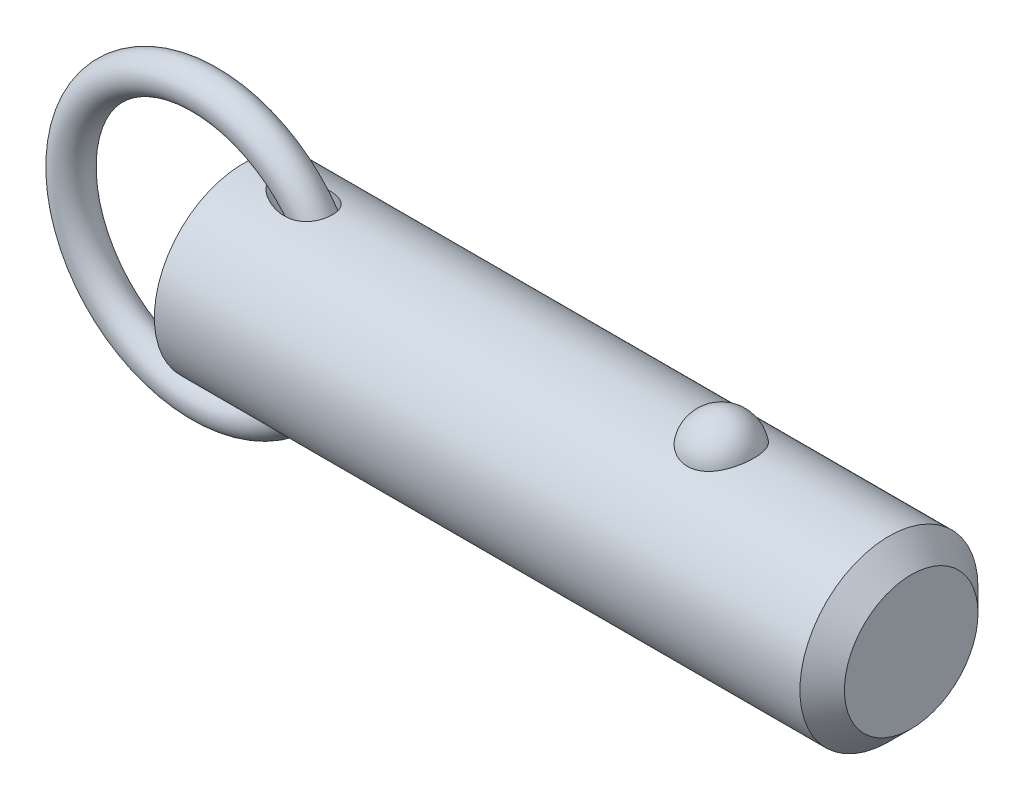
ISO-10303-21;
HEADER;
FILE_DESCRIPTION(('STEP AP214'),'2;1');
FILE_NAME('part.step','',(''),(''),'','','');
FILE_SCHEMA(('AUTOMOTIVE_DESIGN { 1 0 10303 214 1 1 1 1 }'));
ENDSEC;
DATA;
#1=APPLICATION_CONTEXT('core data for automotive mechanical design processes');
#2=APPLICATION_PROTOCOL_DEFINITION('international standard','automotive_design',2000,#1);
#3=PRODUCT_CONTEXT('',#1,'mechanical');
#4=PRODUCT('Part','Part','',(#3));
#5=PRODUCT_RELATED_PRODUCT_CATEGORY('part','',(#4));
#6=PRODUCT_DEFINITION_FORMATION('','',#4);
#7=PRODUCT_DEFINITION_CONTEXT('part definition',#1,'design');
#8=PRODUCT_DEFINITION('design','',#6,#7);
#9=PRODUCT_DEFINITION_SHAPE('','',#8);
#10=(LENGTH_UNIT() NAMED_UNIT(*) SI_UNIT(.MILLI.,.METRE.));
#11=(NAMED_UNIT(*) PLANE_ANGLE_UNIT() SI_UNIT($,.RADIAN.));
#12=(NAMED_UNIT(*) SI_UNIT($,.STERADIAN.) SOLID_ANGLE_UNIT());
#13=UNCERTAINTY_MEASURE_WITH_UNIT(LENGTH_MEASURE(1.E-05),#10,'distance_accuracy_value','');
#14=(GEOMETRIC_REPRESENTATION_CONTEXT(3) GLOBAL_UNCERTAINTY_ASSIGNED_CONTEXT((#13)) GLOBAL_UNIT_ASSIGNED_CONTEXT((#10,
#11,#12)) REPRESENTATION_CONTEXT('',''));
#15=CARTESIAN_POINT('',(0.,0.,0.));
#16=DIRECTION('',(0.,0.,1.));
#17=DIRECTION('',(1.,0.,0.));
#18=AXIS2_PLACEMENT_3D('',#15,#16,#17);
#19=CARTESIAN_POINT('',(-5.53898640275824,0.,0.));
#20=DIRECTION('',(0.,0.,1.));
#21=DIRECTION('',(1.,0.,0.));
#22=AXIS2_PLACEMENT_3D('',#19,#20,#21);
#23=TOROIDAL_SURFACE('',#22,19.05,2.54);
#24=CARTESIAN_POINT('',(16.0510135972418,0.,0.));
#25=VERTEX_POINT('',#24);
#26=VERTEX_LOOP('',#25);
#27=FACE_BOUND('',#26,.T.);
#28=ADVANCED_FACE('P0_F12',(#27),#23,.T.);
#29=CLOSED_SHELL('',(#28));
#30=MANIFOLD_SOLID_BREP('P0_B1',#29);
#31=CARTESIAN_POINT('',(0.,0.,0.));
#32=DIRECTION('',(1.,0.,0.));
#33=DIRECTION('',(0.,0.,-1.));
#34=AXIS2_PLACEMENT_3D('',#31,#32,#33);
#35=CYLINDRICAL_SURFACE('',#34,12.7);
#36=CARTESIAN_POINT('',(92.075,0.,0.));
#37=DIRECTION('',(1.,0.,0.));
#38=DIRECTION('',(0.,0.,-1.));
#39=AXIS2_PLACEMENT_3D('',#36,#37,#38);
#40=CIRCLE('',#39,12.7);
#41=CARTESIAN_POINT('',(92.075,0.,-12.7));
#42=VERTEX_POINT('',#41);
#43=EDGE_CURVE('P1_E89',#42,#42,#40,.T.);
#44=ORIENTED_EDGE('',*,*,#43,.F.);
#45=EDGE_LOOP('',(#44));
#46=FACE_BOUND('',#45,.T.);
#47=CARTESIAN_POINT('',(0.,0.,0.));
#48=DIRECTION('',(1.,0.,0.));
#49=DIRECTION('',(0.,0.,-1.));
#50=AXIS2_PLACEMENT_3D('',#47,#48,#49);
#51=CIRCLE('',#50,12.7);
#52=CARTESIAN_POINT('',(0.,0.,-12.7));
#53=VERTEX_POINT('',#52);
#54=EDGE_CURVE('P1_E52',#53,#53,#51,.T.);
#55=ORIENTED_EDGE('',*,*,#54,.T.);
#56=EDGE_LOOP('',(#55));
#57=FACE_BOUND('',#56,.T.);
#58=CARTESIAN_POINT('',(68.1600429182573,11.7500437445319,4.8193850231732));
#59=CARTESIAN_POINT('',(68.0350881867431,11.7500430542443,4.81938571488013));
#60=CARTESIAN_POINT('',(67.910144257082,11.7520975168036,4.81438658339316));
#61=CARTESIAN_POINT('',(67.6611425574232,11.760253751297,4.79442904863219));
#62=CARTESIAN_POINT('',(67.5370850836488,11.7663568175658,4.77946746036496));
#63=CARTESIAN_POINT('',(67.2909016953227,11.7824262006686,4.73971414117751));
#64=CARTESIAN_POINT('',(67.1687744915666,11.7923898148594,4.71492928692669));
#65=CARTESIAN_POINT('',(66.9271874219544,11.8158938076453,4.65571340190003));
#66=CARTESIAN_POINT('',(66.8077285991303,11.8294355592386,4.62127866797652));
#67=CARTESIAN_POINT('',(66.5725578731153,11.8596812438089,4.54309502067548));
#68=CARTESIAN_POINT('',(66.4568393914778,11.8763792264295,4.4993636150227));
#69=CARTESIAN_POINT('',(66.2296530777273,11.9124878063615,4.40287235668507));
#70=CARTESIAN_POINT('',(66.1181868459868,11.9318994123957,4.35010914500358));
#71=CARTESIAN_POINT('',(65.7912782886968,11.9934256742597,4.17881316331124));
#72=CARTESIAN_POINT('',(65.5831270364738,12.038858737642,4.04720756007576));
#73=CARTESIAN_POINT('',(65.1858509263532,12.1352173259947,3.74856446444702));
#74=CARTESIAN_POINT('',(64.9974438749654,12.1862630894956,3.58061821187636));
#75=CARTESIAN_POINT('',(64.6505213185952,12.2875163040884,3.21600758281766));
#76=CARTESIAN_POINT('',(64.4920113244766,12.3377235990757,3.01933792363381));
#77=CARTESIAN_POINT('',(64.2016887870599,12.434492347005,2.59291655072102));
#78=CARTESIAN_POINT('',(64.0713762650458,12.4807925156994,2.36208286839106));
#79=CARTESIAN_POINT('',(63.8494079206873,12.5623454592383,1.88070399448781));
#80=CARTESIAN_POINT('',(63.7577554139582,12.5975972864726,1.63015711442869));
#81=CARTESIAN_POINT('',(63.6140466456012,12.6538414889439,1.11298869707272));
#82=CARTESIAN_POINT('',(63.5624990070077,12.6746503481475,0.846205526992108));
#83=CARTESIAN_POINT('',(63.5019771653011,12.699153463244,0.307085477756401));
#84=CARTESIAN_POINT('',(63.4930018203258,12.7028481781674,0.034748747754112));
#85=CARTESIAN_POINT('',(63.5177310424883,12.6927785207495,-0.506073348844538));
#86=CARTESIAN_POINT('',(63.5511899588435,12.6791146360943,-0.774571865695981));
#87=CARTESIAN_POINT('',(63.6596877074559,12.635882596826,-1.3017024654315));
#88=CARTESIAN_POINT('',(63.7347272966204,12.6063141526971,-1.56033436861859));
#89=CARTESIAN_POINT('',(63.9250000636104,12.5342328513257,-2.06083899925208));
#90=CARTESIAN_POINT('',(64.0402872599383,12.4917026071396,-2.3026886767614));
#91=CARTESIAN_POINT('',(64.3087044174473,12.3981123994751,-2.76259600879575));
#92=CARTESIAN_POINT('',(64.4618374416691,12.3470517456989,-2.98065173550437));
#93=CARTESIAN_POINT('',(64.8035077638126,12.2416045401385,-3.38786328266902));
#94=CARTESIAN_POINT('',(64.9922017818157,12.1872040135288,-3.57688418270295));
#95=CARTESIAN_POINT('',(65.4002392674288,12.0814086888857,-3.91941073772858));
#96=CARTESIAN_POINT('',(65.6195800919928,12.0300136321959,-4.07291945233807));
#97=CARTESIAN_POINT('',(66.078375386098,11.9373542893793,-4.33691289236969));
#98=CARTESIAN_POINT('',(66.3173044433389,11.8958982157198,-4.44824125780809));
#99=CARTESIAN_POINT('',(66.8124376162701,11.8268116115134,-4.62881985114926));
#100=CARTESIAN_POINT('',(67.0686351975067,11.7991758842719,-4.69808589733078));
#101=CARTESIAN_POINT('',(67.5771640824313,11.7622209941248,-4.78983181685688));
#102=CARTESIAN_POINT('',(67.8290414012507,11.7520502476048,-4.81449025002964));
#103=CARTESIAN_POINT('',(68.3335734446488,11.7485796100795,-4.82295735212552));
#104=CARTESIAN_POINT('',(68.5862280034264,11.7552763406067,-4.80677420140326));
#105=CARTESIAN_POINT('',(69.0768341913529,11.7842584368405,-4.73525430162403));
#106=CARTESIAN_POINT('',(69.3149984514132,11.8060486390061,-4.68116061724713));
#107=CARTESIAN_POINT('',(69.7784894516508,11.8622750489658,-4.53678133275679));
#108=CARTESIAN_POINT('',(70.0038151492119,11.8967122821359,-4.44649279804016));
#109=CARTESIAN_POINT('',(70.4408018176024,11.9754603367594,-4.22987613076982));
#110=CARTESIAN_POINT('',(70.6520579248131,12.0199699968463,-4.10280539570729));
#111=CARTESIAN_POINT('',(71.0506012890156,12.1138028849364,-3.81685409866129));
#112=CARTESIAN_POINT('',(71.2378830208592,12.163127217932,-3.65796622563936));
#113=CARTESIAN_POINT('',(71.5933509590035,12.2642343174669,-3.30364864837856));
#114=CARTESIAN_POINT('',(71.7601119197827,12.3160165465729,-3.10678783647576));
#115=CARTESIAN_POINT('',(72.0595799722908,12.4142566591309,-2.68748409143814));
#116=CARTESIAN_POINT('',(72.1922809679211,12.4607135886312,-2.46503658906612));
#117=CARTESIAN_POINT('',(72.4246912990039,12.5450236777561,-1.99289519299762));
#118=CARTESIAN_POINT('',(72.523215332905,12.5825557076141,-1.74255918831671));
#119=CARTESIAN_POINT('',(72.6792277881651,12.6431720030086,-1.22773734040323));
#120=CARTESIAN_POINT('',(72.7367157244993,12.6662560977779,-0.96325132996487));
#121=CARTESIAN_POINT('',(72.8095441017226,12.6956486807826,-0.427355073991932));
#122=CARTESIAN_POINT('',(72.8248378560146,12.7019385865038,-0.155937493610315));
#123=CARTESIAN_POINT('',(72.8127794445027,12.6970201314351,0.385928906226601));
#124=CARTESIAN_POINT('',(72.7854280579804,12.6858120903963,0.656377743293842));
#125=CARTESIAN_POINT('',(72.7130609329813,12.6568455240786,1.0545401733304));
#126=CARTESIAN_POINT('',(72.6837963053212,12.6451962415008,1.18577850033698));
#127=CARTESIAN_POINT('',(72.6150228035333,12.6181819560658,1.44513808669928));
#128=CARTESIAN_POINT('',(72.5755176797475,12.6028183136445,1.57326046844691));
#129=CARTESIAN_POINT('',(72.4864397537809,12.5687547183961,1.82554978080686));
#130=CARTESIAN_POINT('',(72.4368627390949,12.5500533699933,1.94971503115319));
#131=CARTESIAN_POINT('',(72.3279211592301,12.5098093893,2.1931437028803));
#132=CARTESIAN_POINT('',(72.2685601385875,12.4882677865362,2.31240887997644));
#133=CARTESIAN_POINT('',(72.1399712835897,12.4427679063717,2.54593031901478));
#134=CARTESIAN_POINT('',(72.0706888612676,12.4187964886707,2.66015396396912));
#135=CARTESIAN_POINT('',(71.922903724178,12.3691892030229,2.88202659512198));
#136=CARTESIAN_POINT('',(71.8444044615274,12.3435539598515,2.98967802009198));
#137=CARTESIAN_POINT('',(71.6785502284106,12.2912955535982,3.19774385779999));
#138=CARTESIAN_POINT('',(71.5911918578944,12.2646720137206,3.298155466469));
#139=CARTESIAN_POINT('',(71.4081617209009,12.2111945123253,3.49095035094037));
#140=CARTESIAN_POINT('',(71.3124932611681,12.1843406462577,3.58333679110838));
#141=CARTESIAN_POINT('',(71.1136272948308,12.1312249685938,3.75922876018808));
#142=CARTESIAN_POINT('',(71.0104503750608,12.104961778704,3.84275713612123));
#143=CARTESIAN_POINT('',(70.7970133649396,12.0537284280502,4.00056406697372));
#144=CARTESIAN_POINT('',(70.6867562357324,12.028757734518,4.07484645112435));
#145=CARTESIAN_POINT('',(70.4597550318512,11.9808306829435,4.21367959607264));
#146=CARTESIAN_POINT('',(70.3430068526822,11.9578756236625,4.27822410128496));
#147=CARTESIAN_POINT('',(70.1039425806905,11.9147184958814,4.39698483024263));
#148=CARTESIAN_POINT('',(69.9816287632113,11.894515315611,4.45120522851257));
#149=CARTESIAN_POINT('',(69.7229527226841,11.8561129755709,4.55255353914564));
#150=CARTESIAN_POINT('',(69.5862237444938,11.8381764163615,4.59884858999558));
#151=CARTESIAN_POINT('',(69.3086087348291,11.8069093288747,4.67853897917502));
#152=CARTESIAN_POINT('',(69.1677245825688,11.7935767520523,4.71194005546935));
#153=CARTESIAN_POINT('',(68.8830944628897,11.7720277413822,4.76552188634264));
#154=CARTESIAN_POINT('',(68.7393488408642,11.7638106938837,4.78570422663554));
#155=CARTESIAN_POINT('',(68.4504114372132,11.7528195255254,4.8126343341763));
#156=CARTESIAN_POINT('',(68.3052198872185,11.7500445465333,4.81938421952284));
#157=CARTESIAN_POINT('',(68.1600429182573,11.7500437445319,4.8193850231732));
#158=B_SPLINE_CURVE_WITH_KNOTS('',3,(#58,#59,#60,#61,#62,#63,#64,#65,#66,#67,#68,#69,#70,#71,
#72,#73,#74,#75,#76,#77,#78,#79,#80,#81,#82,#83,#84,#85,#86,#87,#88,#89,#90,#91,#92,#93,#94,#95,
#96,#97,#98,#99,#100,#101,#102,#103,#104,#105,#106,#107,#108,#109,#110,#111,#112,#113,#114,#115,
#116,#117,#118,#119,#120,#121,#122,#123,#124,#125,#126,#127,#128,#129,#130,#131,#132,#133,#134,
#135,#136,#137,#138,#139,#140,#141,#142,#143,#144,#145,#146,#147,#148,#149,#150,#151,#152,#153,
#154,#155,#156,#157),.UNSPECIFIED.,.T.,.F.,(4,2,2,2,2,2,2,2,2,2,2,2,2,2,2,2,2,2,2,2,2,2,2,2,2,2,
2,2,2,2,2,2,2,2,2,2,2,2,2,2,2,2,2,2,2,2,2,2,2,4),(0.,0.374729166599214,0.749578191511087,
1.12416526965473,1.49889629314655,1.87292776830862,2.24709865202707,2.99481328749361,
3.76399449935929,4.5333173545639,5.33683915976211,6.14042986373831,6.95405296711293,
7.7676542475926,8.57656703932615,9.38549455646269,10.1955119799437,11.0055949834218,
11.8193353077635,12.6330054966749,13.4294141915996,14.2255231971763,14.9815786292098,
15.7374826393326,16.4696948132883,17.2019663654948,17.9501979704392,18.6986017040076,
19.4844704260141,20.2704797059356,21.0815215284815,21.8925729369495,22.70452139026,
23.5164550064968,23.9209608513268,24.3253187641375,24.7298461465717,25.1342272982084,
25.5409255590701,25.947471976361,26.3541750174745,26.7607169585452,27.166183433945,
27.5714814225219,27.9770386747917,28.3824315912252,28.8181206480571,29.2536155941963,
29.6890582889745,30.1244323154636),.UNSPECIFIED.);
#159=CARTESIAN_POINT('',(68.1600429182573,11.7500437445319,4.8193850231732));
#160=VERTEX_POINT('',#159);
#161=EDGE_CURVE('P1_E80',#160,#160,#158,.T.);
#162=ORIENTED_EDGE('',*,*,#161,.T.);
#163=EDGE_LOOP('',(#162));
#164=FACE_BOUND('',#163,.T.);
#165=CARTESIAN_POINT('',(-5.53898640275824,0.,0.));
#166=DIRECTION('',(0.796400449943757,-0.604769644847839,0.));
#167=DIRECTION('',(0.604769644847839,0.796400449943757,0.));
#168=AXIS2_PLACEMENT_3D('',#165,#166,#167);
#169=ELLIPSE('',#168,15.9467514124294,12.7);
#170=CARTESIAN_POINT('',(4.09482149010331,12.6864319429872,0.586893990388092));
#171=VERTEX_POINT('',#170);
#172=CARTESIAN_POINT('',(4.09482149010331,12.6864319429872,-0.586893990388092));
#173=VERTEX_POINT('',#172);
#174=EDGE_CURVE('P1_E47',#171,#173,#169,.F.);
#175=ORIENTED_EDGE('',*,*,#174,.T.);
#176=CARTESIAN_POINT('',(4.06153170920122,12.6905758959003,-0.48916605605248));
#177=CARTESIAN_POINT('',(4.08111374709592,12.6881366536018,-0.552489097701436));
#178=CARTESIAN_POINT('',(4.10417851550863,12.6852663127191,-0.614604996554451));
#179=CARTESIAN_POINT('',(4.1562843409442,12.6787965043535,-0.736067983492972));
#180=CARTESIAN_POINT('',(4.18531032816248,12.6751988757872,-0.795421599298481));
#181=CARTESIAN_POINT('',(4.27911159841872,12.6636052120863,-0.967590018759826));
#182=CARTESIAN_POINT('',(4.35123408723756,12.654730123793,-1.07635920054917));
#183=CARTESIAN_POINT('',(4.49106800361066,12.6376715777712,-1.25922957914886));
#184=CARTESIAN_POINT('',(4.5560106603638,12.6297947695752,-1.33556751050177));
#185=CARTESIAN_POINT('',(4.69223626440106,12.6134116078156,-1.48232741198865));
#186=CARTESIAN_POINT('',(4.7635214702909,12.6049050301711,-1.55274725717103));
#187=CARTESIAN_POINT('',(4.91163946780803,12.587417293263,-1.68868704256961));
#188=CARTESIAN_POINT('',(4.98851399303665,12.5784327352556,-1.75416062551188));
#189=CARTESIAN_POINT('',(5.14630057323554,12.560235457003,-1.88003275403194));
#190=CARTESIAN_POINT('',(5.22721398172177,12.5510226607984,-1.94042957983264));
#191=CARTESIAN_POINT('',(5.45368877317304,12.5256514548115,-2.09966332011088));
#192=CARTESIAN_POINT('',(5.60261616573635,12.5094182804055,-2.19371988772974));
#193=CARTESIAN_POINT('',(5.90795545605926,12.4774211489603,-2.36893890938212));
#194=CARTESIAN_POINT('',(6.06437232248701,12.4616575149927,-2.45009264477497));
#195=CARTESIAN_POINT('',(6.38306132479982,12.431227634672,-2.60008249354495));
#196=CARTESIAN_POINT('',(6.54533237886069,12.4165611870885,-2.66892086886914));
#197=CARTESIAN_POINT('',(6.87462618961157,12.3889351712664,-2.79435199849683));
#198=CARTESIAN_POINT('',(7.0416477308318,12.3759751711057,-2.85094785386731));
#199=CARTESIAN_POINT('',(7.38726647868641,12.3518460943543,-2.95377962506));
#200=CARTESIAN_POINT('',(7.56604577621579,12.3407843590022,-2.9994320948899));
#201=CARTESIAN_POINT('',(7.92698692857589,12.3219309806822,-3.07596683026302));
#202=CARTESIAN_POINT('',(8.10914972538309,12.314140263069,-3.1068449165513));
#203=CARTESIAN_POINT('',(8.47511457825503,12.3025918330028,-3.15226850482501));
#204=CARTESIAN_POINT('',(8.6589097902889,12.2988216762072,-3.16686440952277));
#205=CARTESIAN_POINT('',(9.02696087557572,12.2959421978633,-3.17802250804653));
#206=CARTESIAN_POINT('',(9.21121628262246,12.2968292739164,-3.17459864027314));
#207=CARTESIAN_POINT('',(9.61636263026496,12.3045198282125,-3.14471110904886));
#208=CARTESIAN_POINT('',(9.83695552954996,12.3125080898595,-3.1136323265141));
#209=CARTESIAN_POINT('',(10.1619126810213,12.3303028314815,-3.04206574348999));
#210=CARTESIAN_POINT('',(10.2692747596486,12.3372061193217,-3.01403983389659));
#211=CARTESIAN_POINT('',(10.4811758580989,12.3528538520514,-2.94925947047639));
#212=CARTESIAN_POINT('',(10.5857162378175,12.361597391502,-2.91250930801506));
#213=CARTESIAN_POINT('',(10.7921321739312,12.3808585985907,-2.82951748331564));
#214=CARTESIAN_POINT('',(10.8939665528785,12.3913944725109,-2.78317723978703));
#215=CARTESIAN_POINT('',(11.0926118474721,12.4138762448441,-2.68112002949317));
#216=CARTESIAN_POINT('',(11.1894254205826,12.4258213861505,-2.62540809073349));
#217=CARTESIAN_POINT('',(11.3768740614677,12.4507225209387,-2.50465655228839));
#218=CARTESIAN_POINT('',(11.46751150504,12.4636781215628,-2.43962056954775));
#219=CARTESIAN_POINT('',(11.641457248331,12.4901070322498,-2.30048560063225));
#220=CARTESIAN_POINT('',(11.7247669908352,12.5035802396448,-2.2263884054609));
#221=CARTESIAN_POINT('',(11.8713131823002,12.5285000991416,-2.08117367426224));
#222=CARTESIAN_POINT('',(11.9357009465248,12.5399538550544,-2.0112159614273));
#223=CARTESIAN_POINT('',(12.0576805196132,12.5624496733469,-1.86555293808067));
#224=CARTESIAN_POINT('',(12.1152732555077,12.5734917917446,-1.7898484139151));
#225=CARTESIAN_POINT('',(12.2230738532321,12.5947858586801,-1.63327883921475));
#226=CARTESIAN_POINT('',(12.2732844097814,12.6050380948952,-1.55241568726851));
#227=CARTESIAN_POINT('',(12.3658430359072,12.6243983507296,-1.38621267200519));
#228=CARTESIAN_POINT('',(12.4081916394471,12.6335064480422,-1.30087311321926));
#229=CARTESIAN_POINT('',(12.5150098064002,12.6569076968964,-1.05702619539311));
#230=CARTESIAN_POINT('',(12.5703399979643,12.6695746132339,-0.894232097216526));
#231=CARTESIAN_POINT('',(12.6526225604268,12.6886816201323,-0.561391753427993));
#232=CARTESIAN_POINT('',(12.6795825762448,12.6951233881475,-0.391347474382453));
#233=CARTESIAN_POINT('',(12.7041016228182,12.7009766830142,-0.0537636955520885));
#234=CARTESIAN_POINT('',(12.7024538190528,12.7005778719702,0.113714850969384));
#235=CARTESIAN_POINT('',(12.6717240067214,12.6932548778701,0.445979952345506));
#236=CARTESIAN_POINT('',(12.6426435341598,12.6863310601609,0.61076665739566));
#237=CARTESIAN_POINT('',(12.5579769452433,12.6667465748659,0.932429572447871));
#238=CARTESIAN_POINT('',(12.5024793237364,12.6541050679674,1.08933027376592));
#239=CARTESIAN_POINT('',(12.3665691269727,12.6244558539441,1.39146752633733));
#240=CARTESIAN_POINT('',(12.2861577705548,12.6074483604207,1.53670464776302));
#241=CARTESIAN_POINT('',(12.1018203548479,12.5706804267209,1.81319588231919));
#242=CARTESIAN_POINT('',(11.9976588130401,12.5508932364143,1.94428915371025));
#243=CARTESIAN_POINT('',(11.7695265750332,12.5107540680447,2.18776051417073));
#244=CARTESIAN_POINT('',(11.6455540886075,12.4904020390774,2.30013691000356));
#245=CARTESIAN_POINT('',(11.3759347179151,12.4502278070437,2.50870972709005));
#246=CARTESIAN_POINT('',(11.2295880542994,12.4304654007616,2.60400962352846));
#247=CARTESIAN_POINT('',(10.9239803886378,12.3941696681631,2.7716292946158));
#248=CARTESIAN_POINT('',(10.7647152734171,12.3776373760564,2.84394171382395));
#249=CARTESIAN_POINT('',(10.4192039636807,12.3473062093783,2.9730352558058));
#250=CARTESIAN_POINT('',(10.231933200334,12.3340204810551,3.02717164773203));
#251=CARTESIAN_POINT('',(9.85152982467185,12.3134301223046,3.10986173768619));
#252=CARTESIAN_POINT('',(9.65839336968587,12.3061295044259,3.13839827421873));
#253=CARTESIAN_POINT('',(9.31022514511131,12.2982822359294,3.16897517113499));
#254=CARTESIAN_POINT('',(9.15555718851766,12.2966525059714,3.1752689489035));
#255=CARTESIAN_POINT('',(8.84618945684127,12.2967963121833,3.17471335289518));
#256=CARTESIAN_POINT('',(8.69148970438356,12.2985715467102,3.16785742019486));
#257=CARTESIAN_POINT('',(8.38280471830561,12.3051648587,3.14214692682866));
#258=CARTESIAN_POINT('',(8.22882218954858,12.3099904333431,3.12326280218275));
#259=CARTESIAN_POINT('',(7.92276070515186,12.3222644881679,3.07448013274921));
#260=CARTESIAN_POINT('',(7.77068148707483,12.3297126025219,3.04458312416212));
#261=CARTESIAN_POINT('',(7.46452663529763,12.3470493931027,2.97350781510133));
#262=CARTESIAN_POINT('',(7.31052714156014,12.3570043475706,2.93201910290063));
#263=CARTESIAN_POINT('',(7.00579083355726,12.3787609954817,2.83876185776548));
#264=CARTESIAN_POINT('',(6.85505451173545,12.3905629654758,2.78699178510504));
#265=CARTESIAN_POINT('',(6.55781208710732,12.415528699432,2.6735774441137));
#266=CARTESIAN_POINT('',(6.41129783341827,12.4286895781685,2.61195394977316));
#267=CARTESIAN_POINT('',(6.12302950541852,12.4559398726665,2.47874512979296));
#268=CARTESIAN_POINT('',(5.981273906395,12.4700289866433,2.40716303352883));
#269=CARTESIAN_POINT('',(5.6707312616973,12.5020754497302,2.2355042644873));
#270=CARTESIAN_POINT('',(5.50343839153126,12.5201625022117,2.13268685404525));
#271=CARTESIAN_POINT('',(5.26147616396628,12.5471537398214,1.96522579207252));
#272=CARTESIAN_POINT('',(5.18224299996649,12.5561365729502,1.90713440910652));
#273=CARTESIAN_POINT('',(5.02746475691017,12.573912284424,1.78618989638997));
#274=CARTESIAN_POINT('',(4.95191912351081,12.5827051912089,1.72333748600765));
#275=CARTESIAN_POINT('',(4.81787163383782,12.598469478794,1.60360864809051));
#276=CARTESIAN_POINT('',(4.75865966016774,12.6054958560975,1.54753994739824));
#277=CARTESIAN_POINT('',(4.64406285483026,12.6191906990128,1.43158546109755));
#278=CARTESIAN_POINT('',(4.5886792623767,12.6258590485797,1.37169845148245));
#279=CARTESIAN_POINT('',(4.43014912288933,12.6450546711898,1.18656670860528));
#280=CARTESIAN_POINT('',(4.3337272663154,12.6568788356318,1.05507993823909));
#281=CARTESIAN_POINT('',(4.21252055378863,12.6718304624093,0.848052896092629));
#282=CARTESIAN_POINT('',(4.17660155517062,12.6762773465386,0.779100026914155));
#283=CARTESIAN_POINT('',(4.11264979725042,12.6842122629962,0.637080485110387));
#284=CARTESIAN_POINT('',(4.08466792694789,12.6876941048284,0.563990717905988));
#285=CARTESIAN_POINT('',(4.06153170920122,12.6905758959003,0.4891660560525));
#286=B_SPLINE_CURVE_WITH_KNOTS('',3,(#176,#177,#178,#179,#180,#181,#182,#183,#184,#185,#186,
#187,#188,#189,#190,#191,#192,#193,#194,#195,#196,#197,#198,#199,#200,#201,#202,#203,#204,#205,
#206,#207,#208,#209,#210,#211,#212,#213,#214,#215,#216,#217,#218,#219,#220,#221,#222,#223,#224,
#225,#226,#227,#228,#229,#230,#231,#232,#233,#234,#235,#236,#237,#238,#239,#240,#241,#242,#243,
#244,#245,#246,#247,#248,#249,#250,#251,#252,#253,#254,#255,#256,#257,#258,#259,#260,#261,#262,
#263,#264,#265,#266,#267,#268,#269,#270,#271,#272,#273,#274,#275,#276,#277,#278,#279,#280,#281,
#282,#283,#284,#285),.UNSPECIFIED.,.F.,.F.,(4,2,2,2,2,2,2,2,2,2,2,2,2,2,2,2,2,2,2,2,2,2,2,2,2,2,
2,2,2,2,2,2,2,2,2,2,2,2,2,2,2,2,2,2,2,2,2,2,2,2,2,2,2,2,4),(0.,0.198708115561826,
0.39691995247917,0.787580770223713,1.08882492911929,1.39017679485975,1.69407136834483,
1.99806847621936,2.52793143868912,3.05815092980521,3.58827293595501,4.11826050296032,
4.67218806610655,5.22627222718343,5.77863637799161,6.3305733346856,6.99657211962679,
7.32977411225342,7.66281254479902,7.99946156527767,8.33593054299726,8.67226935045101,
9.00854178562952,9.29544181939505,9.58230266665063,9.86905853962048,10.1557949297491,
10.6702338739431,11.1845341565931,11.6845985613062,12.1846349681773,12.6830079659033,
13.1813565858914,13.68487951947,14.1884479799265,14.713533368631,15.2387866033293,
15.8228373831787,16.407279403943,16.8710810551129,17.3351141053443,17.8002921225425,
18.2654052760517,18.7444169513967,19.2235004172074,19.7015868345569,20.1795185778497,
20.7699825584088,21.0658110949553,21.3615950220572,21.606957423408,21.8523988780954,
22.3397467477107,22.5729183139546,22.8075527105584),.UNSPECIFIED.);
#287=EDGE_CURVE('P1_E51',#173,#171,#286,.T.);
#288=ORIENTED_EDGE('',*,*,#287,.T.);
#289=EDGE_LOOP('',(#175,#288));
#290=FACE_BOUND('',#289,.T.);
#291=CARTESIAN_POINT('',(-5.53898640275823,0.,0.));
#292=DIRECTION('',(-0.796400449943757,-0.604769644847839,0.));
#293=DIRECTION('',(0.604769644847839,-0.796400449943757,0.));
#294=AXIS2_PLACEMENT_3D('',#291,#292,#293);
#295=ELLIPSE('',#294,15.9467514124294,12.7);
#296=CARTESIAN_POINT('',(4.09482149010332,-12.6864319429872,0.586893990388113));
#297=VERTEX_POINT('',#296);
#298=CARTESIAN_POINT('',(4.09482149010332,-12.6864319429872,-0.586893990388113));
#299=VERTEX_POINT('',#298);
#300=EDGE_CURVE('P1_E28',#297,#299,#295,.F.);
#301=ORIENTED_EDGE('',*,*,#300,.F.);
#302=CARTESIAN_POINT('',(4.06153170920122,-12.6905758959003,0.489166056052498));
#303=CARTESIAN_POINT('',(4.08111374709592,-12.6881366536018,0.552489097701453));
#304=CARTESIAN_POINT('',(4.10417851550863,-12.6852663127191,0.614604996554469));
#305=CARTESIAN_POINT('',(4.15628434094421,-12.6787965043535,0.736067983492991));
#306=CARTESIAN_POINT('',(4.18531032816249,-12.6751988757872,0.795421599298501));
#307=CARTESIAN_POINT('',(4.27911159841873,-12.6636052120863,0.967590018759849));
#308=CARTESIAN_POINT('',(4.35123408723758,-12.654730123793,1.07635920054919));
#309=CARTESIAN_POINT('',(4.49106800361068,-12.6376715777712,1.25922957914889));
#310=CARTESIAN_POINT('',(4.55601066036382,-12.6297947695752,1.3355675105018));
#311=CARTESIAN_POINT('',(4.69223626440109,-12.6134116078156,1.48232741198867));
#312=CARTESIAN_POINT('',(4.76352147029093,-12.6049050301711,1.55274725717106));
#313=CARTESIAN_POINT('',(4.91163946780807,-12.587417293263,1.68868704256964));
#314=CARTESIAN_POINT('',(4.98851399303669,-12.5784327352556,1.75416062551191));
#315=CARTESIAN_POINT('',(5.14630057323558,-12.560235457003,1.88003275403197));
#316=CARTESIAN_POINT('',(5.22721398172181,-12.5510226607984,1.94042957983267));
#317=CARTESIAN_POINT('',(5.45368877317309,-12.5256514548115,2.09966332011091));
#318=CARTESIAN_POINT('',(5.60261616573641,-12.5094182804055,2.19371988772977));
#319=CARTESIAN_POINT('',(5.90795545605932,-12.4774211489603,2.36893890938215));
#320=CARTESIAN_POINT('',(6.06437232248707,-12.4616575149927,2.450092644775));
#321=CARTESIAN_POINT('',(6.38306132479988,-12.431227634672,2.60008249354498));
#322=CARTESIAN_POINT('',(6.54533237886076,-12.4165611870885,2.66892086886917));
#323=CARTESIAN_POINT('',(6.87462618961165,-12.3889351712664,2.79435199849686));
#324=CARTESIAN_POINT('',(7.04164773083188,-12.3759751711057,2.85094785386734));
#325=CARTESIAN_POINT('',(7.38726647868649,-12.3518460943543,2.95377962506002));
#326=CARTESIAN_POINT('',(7.56604577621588,-12.3407843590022,2.99943209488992));
#327=CARTESIAN_POINT('',(7.92698692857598,-12.3219309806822,3.07596683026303));
#328=CARTESIAN_POINT('',(8.10914972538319,-12.314140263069,3.10684491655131));
#329=CARTESIAN_POINT('',(8.47511457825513,-12.3025918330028,3.15226850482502));
#330=CARTESIAN_POINT('',(8.65890979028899,-12.2988216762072,3.16686440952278));
#331=CARTESIAN_POINT('',(9.02696087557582,-12.2959421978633,3.17802250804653));
#332=CARTESIAN_POINT('',(9.21121628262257,-12.2968292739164,3.17459864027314));
#333=CARTESIAN_POINT('',(9.61636263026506,-12.3045198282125,3.14471110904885));
#334=CARTESIAN_POINT('',(9.83695552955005,-12.3125080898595,3.11363232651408));
#335=CARTESIAN_POINT('',(10.1619126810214,-12.3303028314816,3.04206574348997));
#336=CARTESIAN_POINT('',(10.2692747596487,-12.3372061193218,3.01403983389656));
#337=CARTESIAN_POINT('',(10.481175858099,-12.3528538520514,2.94925947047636));
#338=CARTESIAN_POINT('',(10.5857162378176,-12.361597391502,2.91250930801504));
#339=CARTESIAN_POINT('',(10.7921321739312,-12.3808585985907,2.82951748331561));
#340=CARTESIAN_POINT('',(10.8939665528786,-12.3913944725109,2.78317723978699));
#341=CARTESIAN_POINT('',(11.0926118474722,-12.4138762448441,2.68112002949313));
#342=CARTESIAN_POINT('',(11.1894254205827,-12.4258213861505,2.62540809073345));
#343=CARTESIAN_POINT('',(11.3768740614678,-12.4507225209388,2.50465655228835));
#344=CARTESIAN_POINT('',(11.4675115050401,-12.4636781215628,2.4396205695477));
#345=CARTESIAN_POINT('',(11.641457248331,-12.4901070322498,2.3004856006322));
#346=CARTESIAN_POINT('',(11.7247669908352,-12.5035802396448,2.22638840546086));
#347=CARTESIAN_POINT('',(11.8713131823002,-12.5285000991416,2.0811736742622));
#348=CARTESIAN_POINT('',(11.9357009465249,-12.5399538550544,2.01121596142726));
#349=CARTESIAN_POINT('',(12.0576805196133,-12.5624496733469,1.86555293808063));
#350=CARTESIAN_POINT('',(12.1152732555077,-12.5734917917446,1.78984841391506));
#351=CARTESIAN_POINT('',(12.2230738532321,-12.5947858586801,1.63327883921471));
#352=CARTESIAN_POINT('',(12.2732844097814,-12.6050380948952,1.55241568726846));
#353=CARTESIAN_POINT('',(12.3658430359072,-12.6243983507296,1.38621267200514));
#354=CARTESIAN_POINT('',(12.4081916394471,-12.6335064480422,1.30087311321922));
#355=CARTESIAN_POINT('',(12.5150098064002,-12.6569076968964,1.05702619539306));
#356=CARTESIAN_POINT('',(12.5703399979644,-12.6695746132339,0.89423209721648));
#357=CARTESIAN_POINT('',(12.6526225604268,-12.6886816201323,0.561391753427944));
#358=CARTESIAN_POINT('',(12.6795825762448,-12.6951233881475,0.391347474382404));
#359=CARTESIAN_POINT('',(12.7041016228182,-12.7009766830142,0.0537636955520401));
#360=CARTESIAN_POINT('',(12.7024538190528,-12.7005778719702,-0.113714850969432));
#361=CARTESIAN_POINT('',(12.6717240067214,-12.6932548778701,-0.445979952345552));
#362=CARTESIAN_POINT('',(12.6426435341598,-12.6863310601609,-0.610766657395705));
#363=CARTESIAN_POINT('',(12.5579769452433,-12.6667465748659,-0.932429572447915));
#364=CARTESIAN_POINT('',(12.5024793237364,-12.6541050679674,-1.08933027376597));
#365=CARTESIAN_POINT('',(12.3665691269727,-12.6244558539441,-1.39146752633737));
#366=CARTESIAN_POINT('',(12.2861577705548,-12.6074483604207,-1.53670464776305));
#367=CARTESIAN_POINT('',(12.1018203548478,-12.5706804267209,-1.81319588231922));
#368=CARTESIAN_POINT('',(11.99765881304,-12.5508932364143,-1.94428915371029));
#369=CARTESIAN_POINT('',(11.7695265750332,-12.5107540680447,-2.18776051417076));
#370=CARTESIAN_POINT('',(11.6455540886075,-12.4904020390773,-2.30013691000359));
#371=CARTESIAN_POINT('',(11.375934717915,-12.4502278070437,-2.50870972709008));
#372=CARTESIAN_POINT('',(11.2295880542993,-12.4304654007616,-2.60400962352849));
#373=CARTESIAN_POINT('',(10.9239803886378,-12.3941696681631,-2.77162929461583));
#374=CARTESIAN_POINT('',(10.764715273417,-12.3776373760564,-2.84394171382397));
#375=CARTESIAN_POINT('',(10.4192039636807,-12.3473062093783,-2.97303525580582));
#376=CARTESIAN_POINT('',(10.2319332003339,-12.3340204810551,-3.02717164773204));
#377=CARTESIAN_POINT('',(9.8515298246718,-12.3134301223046,-3.1098617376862));
#378=CARTESIAN_POINT('',(9.65839336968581,-12.3061295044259,-3.13839827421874));
#379=CARTESIAN_POINT('',(9.31022514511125,-12.2982822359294,-3.168975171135));
#380=CARTESIAN_POINT('',(9.1555571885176,-12.2966525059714,-3.1752689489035));
#381=CARTESIAN_POINT('',(8.84618945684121,-12.2967963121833,-3.17471335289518));
#382=CARTESIAN_POINT('',(8.6914897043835,-12.2985715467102,-3.16785742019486));
#383=CARTESIAN_POINT('',(8.38280471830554,-12.3051648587,-3.14214692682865));
#384=CARTESIAN_POINT('',(8.22882218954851,-12.3099904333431,-3.12326280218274));
#385=CARTESIAN_POINT('',(7.92276070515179,-12.3222644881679,-3.07448013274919));
#386=CARTESIAN_POINT('',(7.77068148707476,-12.329712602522,-3.04458312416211));
#387=CARTESIAN_POINT('',(7.46452663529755,-12.3470493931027,-2.97350781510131));
#388=CARTESIAN_POINT('',(7.31052714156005,-12.3570043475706,-2.93201910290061));
#389=CARTESIAN_POINT('',(7.00579083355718,-12.3787609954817,-2.83876185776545));
#390=CARTESIAN_POINT('',(6.85505451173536,-12.3905629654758,-2.78699178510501));
#391=CARTESIAN_POINT('',(6.55781208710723,-12.415528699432,-2.67357744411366));
#392=CARTESIAN_POINT('',(6.41129783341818,-12.4286895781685,-2.61195394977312));
#393=CARTESIAN_POINT('',(6.12302950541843,-12.4559398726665,-2.47874512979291));
#394=CARTESIAN_POINT('',(5.9812739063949,-12.4700289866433,-2.40716303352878));
#395=CARTESIAN_POINT('',(5.6707312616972,-12.5020754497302,-2.23550426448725));
#396=CARTESIAN_POINT('',(5.50343839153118,-12.5201625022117,-2.13268685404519));
#397=CARTESIAN_POINT('',(5.2614761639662,-12.5471537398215,-1.96522579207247));
#398=CARTESIAN_POINT('',(5.18224299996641,-12.5561365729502,-1.90713440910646));
#399=CARTESIAN_POINT('',(5.0274647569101,-12.573912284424,-1.78618989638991));
#400=CARTESIAN_POINT('',(4.95191912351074,-12.5827051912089,-1.7233374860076));
#401=CARTESIAN_POINT('',(4.81787163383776,-12.598469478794,-1.60360864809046));
#402=CARTESIAN_POINT('',(4.75865966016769,-12.6054958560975,-1.54753994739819));
#403=CARTESIAN_POINT('',(4.64406285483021,-12.6191906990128,-1.43158546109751));
#404=CARTESIAN_POINT('',(4.58867926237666,-12.6258590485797,-1.37169845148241));
#405=CARTESIAN_POINT('',(4.43014912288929,-12.6450546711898,-1.18656670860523));
#406=CARTESIAN_POINT('',(4.33372726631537,-12.6568788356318,-1.05507993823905));
#407=CARTESIAN_POINT('',(4.2125205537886,-12.6718304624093,-0.848052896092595));
#408=CARTESIAN_POINT('',(4.17660155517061,-12.6762773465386,-0.779100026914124));
#409=CARTESIAN_POINT('',(4.11264979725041,-12.6842122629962,-0.637080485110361));
#410=CARTESIAN_POINT('',(4.08466792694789,-12.6876941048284,-0.563990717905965));
#411=CARTESIAN_POINT('',(4.06153170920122,-12.6905758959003,-0.489166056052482));
#412=B_SPLINE_CURVE_WITH_KNOTS('',3,(#302,#303,#304,#305,#306,#307,#308,#309,#310,#311,#312,
#313,#314,#315,#316,#317,#318,#319,#320,#321,#322,#323,#324,#325,#326,#327,#328,#329,#330,#331,
#332,#333,#334,#335,#336,#337,#338,#339,#340,#341,#342,#343,#344,#345,#346,#347,#348,#349,#350,
#351,#352,#353,#354,#355,#356,#357,#358,#359,#360,#361,#362,#363,#364,#365,#366,#367,#368,#369,
#370,#371,#372,#373,#374,#375,#376,#377,#378,#379,#380,#381,#382,#383,#384,#385,#386,#387,#388,
#389,#390,#391,#392,#393,#394,#395,#396,#397,#398,#399,#400,#401,#402,#403,#404,#405,#406,#407,
#408,#409,#410,#411),.UNSPECIFIED.,.F.,.F.,(4,2,2,2,2,2,2,2,2,2,2,2,2,2,2,2,2,2,2,2,2,2,2,2,2,2,
2,2,2,2,2,2,2,2,2,2,2,2,2,2,2,2,2,2,2,2,2,2,2,2,2,2,2,2,4),(0.,0.198708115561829,
0.396919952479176,0.787580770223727,1.08882492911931,1.39017679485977,1.69407136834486,
1.9980684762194,2.52793143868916,3.05815092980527,3.58827293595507,4.11826050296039,
4.67218806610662,5.22627222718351,5.77863637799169,6.33057333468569,6.99657211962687,
7.32977411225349,7.66281254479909,7.99946156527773,8.33593054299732,8.67226935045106,
9.00854178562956,9.29544181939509,9.58230266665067,9.86905853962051,10.1557949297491,
10.6702338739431,11.1845341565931,11.6845985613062,12.1846349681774,12.6830079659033,
13.1813565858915,13.68487951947,14.1884479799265,14.7135333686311,15.2387866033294,
15.8228373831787,16.4072794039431,16.871081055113,17.3351141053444,17.8002921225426,
18.2654052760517,18.7444169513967,19.2235004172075,19.701586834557,20.1795185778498,
20.7699825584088,21.0658110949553,21.3615950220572,21.606957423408,21.8523988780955,
22.3397467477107,22.5729183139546,22.8075527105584),.UNSPECIFIED.);
#413=EDGE_CURVE('P1_E10',#297,#299,#412,.T.);
#414=ORIENTED_EDGE('',*,*,#413,.T.);
#415=EDGE_LOOP('',(#301,#414));
#416=FACE_BOUND('',#415,.T.);
#417=ADVANCED_FACE('P1_F15',(#46,#57,#164,#290,#416),#35,.T.);
#418=CARTESIAN_POINT('',(0.,0.,0.));
#419=DIRECTION('',(-1.,0.,0.));
#420=DIRECTION('',(0.,0.,1.));
#421=AXIS2_PLACEMENT_3D('',#418,#419,#420);
#422=PLANE('',#421);
#423=ORIENTED_EDGE('',*,*,#54,.F.);
#424=EDGE_LOOP('',(#423));
#425=FACE_BOUND('',#424,.T.);
#426=ADVANCED_FACE('P1_F17',(#425),#422,.T.);
#427=CARTESIAN_POINT('',(95.25,0.,0.));
#428=DIRECTION('',(-1.,0.,0.));
#429=DIRECTION('',(0.,0.,1.));
#430=AXIS2_PLACEMENT_3D('',#427,#428,#429);
#431=CONICAL_SURFACE('',#430,9.52500000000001,0.785398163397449);
#432=ORIENTED_EDGE('',*,*,#43,.T.);
#433=EDGE_LOOP('',(#432));
#434=FACE_BOUND('',#433,.T.);
#435=CARTESIAN_POINT('',(95.25,0.,0.));
#436=DIRECTION('',(1.,0.,0.));
#437=DIRECTION('',(0.,0.,-1.));
#438=AXIS2_PLACEMENT_3D('',#435,#436,#437);
#439=CIRCLE('',#438,9.52500000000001);
#440=CARTESIAN_POINT('',(95.25,0.,-9.52500000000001));
#441=VERTEX_POINT('',#440);
#442=EDGE_CURVE('P1_E86',#441,#441,#439,.T.);
#443=ORIENTED_EDGE('',*,*,#442,.F.);
#444=EDGE_LOOP('',(#443));
#445=FACE_BOUND('',#444,.T.);
#446=ADVANCED_FACE('P1_F105',(#434,#445),#431,.T.);
#447=CARTESIAN_POINT('',(95.25,9.52500000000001,0.));
#448=DIRECTION('',(1.,0.,0.));
#449=DIRECTION('',(0.,0.,-1.));
#450=AXIS2_PLACEMENT_3D('',#447,#448,#449);
#451=PLANE('',#450);
#452=ORIENTED_EDGE('',*,*,#442,.T.);
#453=EDGE_LOOP('',(#452));
#454=FACE_BOUND('',#453,.T.);
#455=ADVANCED_FACE('P1_F78',(#454),#451,.T.);
#456=CARTESIAN_POINT('',(68.1600429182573,11.43,0.));
#457=DIRECTION('',(-1.,0.,0.));
#458=DIRECTION('',(0.,-1.,0.));
#459=AXIS2_PLACEMENT_3D('',#456,#457,#458);
#460=SPHERICAL_SURFACE('',#459,4.83000000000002);
#461=ORIENTED_EDGE('',*,*,#161,.F.);
#462=EDGE_LOOP('',(#461));
#463=FACE_BOUND('',#462,.T.);
#464=ADVANCED_FACE('P1_F71',(#463),#460,.T.);
#465=CARTESIAN_POINT('',(-5.53898640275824,0.,0.));
#466=DIRECTION('',(0.,0.,1.));
#467=DIRECTION('',(1.,0.,0.));
#468=AXIS2_PLACEMENT_3D('',#465,#466,#467);
#469=TOROIDAL_SURFACE('',#468,19.05,3.175);
#470=CARTESIAN_POINT('',(5.98187533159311,-15.1714285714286,0.));
#471=DIRECTION('',(-0.796400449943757,-0.604769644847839,0.));
#472=DIRECTION('',(0.604769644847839,-0.796400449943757,0.));
#473=AXIS2_PLACEMENT_3D('',#470,#471,#472);
#474=CIRCLE('',#473,3.175);
#475=EDGE_CURVE('P1_E34',#297,#299,#474,.T.);
#476=ORIENTED_EDGE('',*,*,#475,.T.);
#477=ORIENTED_EDGE('',*,*,#413,.F.);
#478=EDGE_LOOP('',(#476,#477));
#479=FACE_BOUND('',#478,.T.);
#480=CARTESIAN_POINT('',(5.9818753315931,15.1714285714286,0.));
#481=DIRECTION('',(0.796400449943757,-0.604769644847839,0.));
#482=DIRECTION('',(0.604769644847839,0.796400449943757,0.));
#483=AXIS2_PLACEMENT_3D('',#480,#481,#482);
#484=CIRCLE('',#483,3.175);
#485=EDGE_CURVE('P1_E41',#171,#173,#484,.T.);
#486=ORIENTED_EDGE('',*,*,#485,.F.);
#487=ORIENTED_EDGE('',*,*,#287,.F.);
#488=EDGE_LOOP('',(#486,#487));
#489=FACE_BOUND('',#488,.T.);
#490=ADVANCED_FACE('P1_F55',(#479,#489),#469,.F.);
#491=CARTESIAN_POINT('',(5.98187533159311,-15.1714285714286,0.));
#492=DIRECTION('',(-0.796400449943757,-0.604769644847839,0.));
#493=DIRECTION('',(0.604769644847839,-0.796400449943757,0.));
#494=AXIS2_PLACEMENT_3D('',#491,#492,#493);
#495=PLANE('',#494);
#496=ORIENTED_EDGE('',*,*,#300,.T.);
#497=ORIENTED_EDGE('',*,*,#475,.F.);
#498=EDGE_LOOP('',(#496,#497));
#499=FACE_BOUND('',#498,.T.);
#500=ADVANCED_FACE('P1_F70',(#499),#495,.F.);
#501=CARTESIAN_POINT('',(5.9818753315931,15.1714285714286,0.));
#502=DIRECTION('',(0.796400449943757,-0.604769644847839,0.));
#503=DIRECTION('',(0.604769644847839,0.796400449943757,0.));
#504=AXIS2_PLACEMENT_3D('',#501,#502,#503);
#505=PLANE('',#504);
#506=ORIENTED_EDGE('',*,*,#485,.T.);
#507=ORIENTED_EDGE('',*,*,#174,.F.);
#508=EDGE_LOOP('',(#506,#507));
#509=FACE_BOUND('',#508,.T.);
#510=ADVANCED_FACE('P1_F48',(#509),#505,.T.);
#511=CLOSED_SHELL('',(#417,#426,#446,#455,#464,#490,#500,#510));
#512=MANIFOLD_SOLID_BREP('P1_B1',#511);
#513=ADVANCED_BREP_SHAPE_REPRESENTATION('',(#18,#30,#512),#14);
#514=SHAPE_DEFINITION_REPRESENTATION(#9,#513);
ENDSEC;
END-ISO-10303-21;
